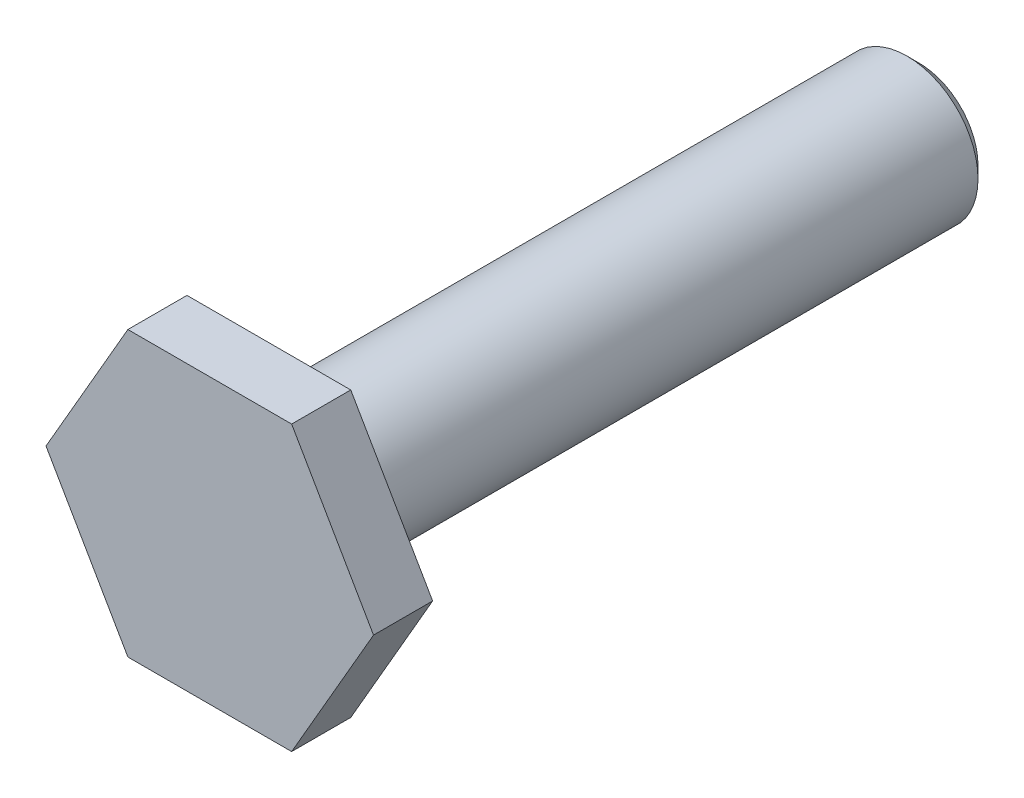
ISO-10303-21;
HEADER;
FILE_DESCRIPTION(('STEP AP214'),'2;1');
FILE_NAME('part.step','',(''),(''),'','','');
FILE_SCHEMA(('AUTOMOTIVE_DESIGN { 1 0 10303 214 1 1 1 1 }'));
ENDSEC;
DATA;
#1=APPLICATION_CONTEXT('core data for automotive mechanical design processes');
#2=APPLICATION_PROTOCOL_DEFINITION('international standard','automotive_design',2000,#1);
#3=PRODUCT_CONTEXT('',#1,'mechanical');
#4=PRODUCT('Part','Part','',(#3));
#5=PRODUCT_RELATED_PRODUCT_CATEGORY('part','',(#4));
#6=PRODUCT_DEFINITION_FORMATION('','',#4);
#7=PRODUCT_DEFINITION_CONTEXT('part definition',#1,'design');
#8=PRODUCT_DEFINITION('design','',#6,#7);
#9=PRODUCT_DEFINITION_SHAPE('','',#8);
#10=(LENGTH_UNIT() NAMED_UNIT(*) SI_UNIT(.MILLI.,.METRE.));
#11=(NAMED_UNIT(*) PLANE_ANGLE_UNIT() SI_UNIT($,.RADIAN.));
#12=(NAMED_UNIT(*) SI_UNIT($,.STERADIAN.) SOLID_ANGLE_UNIT());
#13=UNCERTAINTY_MEASURE_WITH_UNIT(LENGTH_MEASURE(1.E-05),#10,'distance_accuracy_value','');
#14=(GEOMETRIC_REPRESENTATION_CONTEXT(3) GLOBAL_UNCERTAINTY_ASSIGNED_CONTEXT((#13)) GLOBAL_UNIT_ASSIGNED_CONTEXT((#10,
#11,#12)) REPRESENTATION_CONTEXT('',''));
#15=CARTESIAN_POINT('',(0.,0.,0.));
#16=DIRECTION('',(0.,0.,1.));
#17=DIRECTION('',(1.,0.,0.));
#18=AXIS2_PLACEMENT_3D('',#15,#16,#17);
#19=CARTESIAN_POINT('',(0.,0.,5.));
#20=DIRECTION('',(0.,0.,1.));
#21=DIRECTION('',(1.,0.,0.));
#22=AXIS2_PLACEMENT_3D('',#19,#20,#21);
#23=PLANE('',#22);
#24=DIRECTION('',(0.5,-0.866025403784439,0.));
#25=VECTOR('',#24,1.);
#26=CARTESIAN_POINT('',(-6.92820323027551,-12.,5.));
#27=LINE('',#26,#25);
#28=CARTESIAN_POINT('',(-6.92820323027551,-12.,5.));
#29=VERTEX_POINT('',#28);
#30=CARTESIAN_POINT('',(-13.856406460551,0.,5.));
#31=VERTEX_POINT('',#30);
#32=EDGE_CURVE('E89',#29,#31,#27,.F.);
#33=ORIENTED_EDGE('',*,*,#32,.F.);
#34=DIRECTION('',(1.,0.,0.));
#35=VECTOR('',#34,1.);
#36=CARTESIAN_POINT('',(6.92820323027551,-12.,5.));
#37=LINE('',#36,#35);
#38=CARTESIAN_POINT('',(6.92820323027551,-12.,5.));
#39=VERTEX_POINT('',#38);
#40=EDGE_CURVE('E98',#39,#29,#37,.F.);
#41=ORIENTED_EDGE('',*,*,#40,.F.);
#42=DIRECTION('',(0.5,0.866025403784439,0.));
#43=VECTOR('',#42,1.);
#44=CARTESIAN_POINT('',(13.856406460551,0.,5.));
#45=LINE('',#44,#43);
#46=CARTESIAN_POINT('',(13.856406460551,0.,5.));
#47=VERTEX_POINT('',#46);
#48=EDGE_CURVE('E62',#47,#39,#45,.F.);
#49=ORIENTED_EDGE('',*,*,#48,.F.);
#50=DIRECTION('',(-0.5,0.866025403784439,0.));
#51=VECTOR('',#50,1.);
#52=CARTESIAN_POINT('',(6.92820323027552,12.,5.));
#53=LINE('',#52,#51);
#54=CARTESIAN_POINT('',(6.92820323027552,12.,5.));
#55=VERTEX_POINT('',#54);
#56=EDGE_CURVE('E66',#55,#47,#53,.F.);
#57=ORIENTED_EDGE('',*,*,#56,.F.);
#58=DIRECTION('',(1.,0.,0.));
#59=VECTOR('',#58,1.);
#60=CARTESIAN_POINT('',(-6.92820323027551,12.,5.));
#61=LINE('',#60,#59);
#62=CARTESIAN_POINT('',(-6.92820323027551,12.,5.));
#63=VERTEX_POINT('',#62);
#64=EDGE_CURVE('E76',#63,#55,#61,.T.);
#65=ORIENTED_EDGE('',*,*,#64,.F.);
#66=DIRECTION('',(-0.5,-0.866025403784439,0.));
#67=VECTOR('',#66,1.);
#68=CARTESIAN_POINT('',(-13.856406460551,0.,5.));
#69=LINE('',#68,#67);
#70=EDGE_CURVE('E79',#31,#63,#69,.F.);
#71=ORIENTED_EDGE('',*,*,#70,.F.);
#72=EDGE_LOOP('',(#33,#41,#49,#57,#65,#71));
#73=FACE_BOUND('',#72,.T.);
#74=ADVANCED_FACE('F16',(#73),#23,.T.);
#75=CARTESIAN_POINT('',(-6.92820323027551,12.,0.));
#76=DIRECTION('',(0.,1.,0.));
#77=DIRECTION('',(0.,0.,1.));
#78=AXIS2_PLACEMENT_3D('',#75,#76,#77);
#79=PLANE('',#78);
#80=DIRECTION('',(1.,0.,0.));
#81=VECTOR('',#80,1.);
#82=CARTESIAN_POINT('',(0.,12.,0.));
#83=LINE('',#82,#81);
#84=CARTESIAN_POINT('',(6.92820323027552,12.,0.));
#85=VERTEX_POINT('',#84);
#86=CARTESIAN_POINT('',(-6.92820323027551,12.,0.));
#87=VERTEX_POINT('',#86);
#88=EDGE_CURVE('E86',#85,#87,#83,.F.);
#89=ORIENTED_EDGE('',*,*,#88,.T.);
#90=DIRECTION('',(0.,0.,1.));
#91=VECTOR('',#90,1.);
#92=CARTESIAN_POINT('',(-6.92820323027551,12.,0.));
#93=LINE('',#92,#91);
#94=EDGE_CURVE('E83',#63,#87,#93,.F.);
#95=ORIENTED_EDGE('',*,*,#94,.F.);
#96=ORIENTED_EDGE('',*,*,#64,.T.);
#97=DIRECTION('',(0.,0.,1.));
#98=VECTOR('',#97,1.);
#99=CARTESIAN_POINT('',(6.92820323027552,12.,0.));
#100=LINE('',#99,#98);
#101=EDGE_CURVE('E54',#85,#55,#100,.T.);
#102=ORIENTED_EDGE('',*,*,#101,.F.);
#103=EDGE_LOOP('',(#89,#95,#96,#102));
#104=FACE_BOUND('',#103,.T.);
#105=ADVANCED_FACE('F84',(#104),#79,.T.);
#106=CARTESIAN_POINT('',(-13.856406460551,0.,0.));
#107=DIRECTION('',(-0.866025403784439,0.5,0.));
#108=DIRECTION('',(-0.5,-0.866025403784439,0.));
#109=AXIS2_PLACEMENT_3D('',#106,#107,#108);
#110=PLANE('',#109);
#111=DIRECTION('',(-0.5,-0.866025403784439,0.));
#112=VECTOR('',#111,1.);
#113=CARTESIAN_POINT('',(-6.92820323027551,12.,0.));
#114=LINE('',#113,#112);
#115=CARTESIAN_POINT('',(-13.856406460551,0.,0.));
#116=VERTEX_POINT('',#115);
#117=EDGE_CURVE('E119',#87,#116,#114,.T.);
#118=ORIENTED_EDGE('',*,*,#117,.T.);
#119=DIRECTION('',(0.,0.,1.));
#120=VECTOR('',#119,1.);
#121=CARTESIAN_POINT('',(-13.856406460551,0.,0.));
#122=LINE('',#121,#120);
#123=EDGE_CURVE('E93',#31,#116,#122,.F.);
#124=ORIENTED_EDGE('',*,*,#123,.F.);
#125=ORIENTED_EDGE('',*,*,#70,.T.);
#126=ORIENTED_EDGE('',*,*,#94,.T.);
#127=EDGE_LOOP('',(#118,#124,#125,#126));
#128=FACE_BOUND('',#127,.T.);
#129=ADVANCED_FACE('F91',(#128),#110,.T.);
#130=CARTESIAN_POINT('',(-6.92820323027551,-12.,0.));
#131=DIRECTION('',(-0.866025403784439,-0.5,0.));
#132=DIRECTION('',(0.5,-0.866025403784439,0.));
#133=AXIS2_PLACEMENT_3D('',#130,#131,#132);
#134=PLANE('',#133);
#135=DIRECTION('',(0.5,-0.866025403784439,0.));
#136=VECTOR('',#135,1.);
#137=CARTESIAN_POINT('',(-13.856406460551,0.,0.));
#138=LINE('',#137,#136);
#139=CARTESIAN_POINT('',(-6.92820323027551,-12.,0.));
#140=VERTEX_POINT('',#139);
#141=EDGE_CURVE('E117',#116,#140,#138,.T.);
#142=ORIENTED_EDGE('',*,*,#141,.T.);
#143=DIRECTION('',(0.,0.,1.));
#144=VECTOR('',#143,1.);
#145=CARTESIAN_POINT('',(-6.92820323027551,-12.,0.));
#146=LINE('',#145,#144);
#147=EDGE_CURVE('E100',#29,#140,#146,.F.);
#148=ORIENTED_EDGE('',*,*,#147,.F.);
#149=ORIENTED_EDGE('',*,*,#32,.T.);
#150=ORIENTED_EDGE('',*,*,#123,.T.);
#151=EDGE_LOOP('',(#142,#148,#149,#150));
#152=FACE_BOUND('',#151,.T.);
#153=ADVANCED_FACE('F182',(#152),#134,.T.);
#154=CARTESIAN_POINT('',(6.92820323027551,-12.,0.));
#155=DIRECTION('',(0.,-1.,0.));
#156=DIRECTION('',(1.,0.,0.));
#157=AXIS2_PLACEMENT_3D('',#154,#155,#156);
#158=PLANE('',#157);
#159=DIRECTION('',(1.,0.,0.));
#160=VECTOR('',#159,1.);
#161=CARTESIAN_POINT('',(0.,-12.,0.));
#162=LINE('',#161,#160);
#163=CARTESIAN_POINT('',(6.92820323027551,-12.,0.));
#164=VERTEX_POINT('',#163);
#165=EDGE_CURVE('E115',#140,#164,#162,.T.);
#166=ORIENTED_EDGE('',*,*,#165,.T.);
#167=DIRECTION('',(0.,0.,1.));
#168=VECTOR('',#167,1.);
#169=CARTESIAN_POINT('',(6.9282032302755,-12.,0.));
#170=LINE('',#169,#168);
#171=EDGE_CURVE('E105',#39,#164,#170,.F.);
#172=ORIENTED_EDGE('',*,*,#171,.F.);
#173=ORIENTED_EDGE('',*,*,#40,.T.);
#174=ORIENTED_EDGE('',*,*,#147,.T.);
#175=EDGE_LOOP('',(#166,#172,#173,#174));
#176=FACE_BOUND('',#175,.T.);
#177=ADVANCED_FACE('F175',(#176),#158,.T.);
#178=CARTESIAN_POINT('',(13.856406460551,0.,0.));
#179=DIRECTION('',(0.866025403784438,-0.5,0.));
#180=DIRECTION('',(0.5,0.866025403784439,0.));
#181=AXIS2_PLACEMENT_3D('',#178,#179,#180);
#182=PLANE('',#181);
#183=DIRECTION('',(0.5,0.866025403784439,0.));
#184=VECTOR('',#183,1.);
#185=CARTESIAN_POINT('',(6.92820323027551,-12.,0.));
#186=LINE('',#185,#184);
#187=CARTESIAN_POINT('',(13.856406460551,0.,0.));
#188=VERTEX_POINT('',#187);
#189=EDGE_CURVE('E35',#164,#188,#186,.T.);
#190=ORIENTED_EDGE('',*,*,#189,.T.);
#191=DIRECTION('',(0.,0.,1.));
#192=VECTOR('',#191,1.);
#193=CARTESIAN_POINT('',(13.856406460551,0.,0.));
#194=LINE('',#193,#192);
#195=EDGE_CURVE('E109',#47,#188,#194,.F.);
#196=ORIENTED_EDGE('',*,*,#195,.F.);
#197=ORIENTED_EDGE('',*,*,#48,.T.);
#198=ORIENTED_EDGE('',*,*,#171,.T.);
#199=EDGE_LOOP('',(#190,#196,#197,#198));
#200=FACE_BOUND('',#199,.T.);
#201=ADVANCED_FACE('F142',(#200),#182,.T.);
#202=CARTESIAN_POINT('',(6.92820323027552,12.,0.));
#203=DIRECTION('',(0.866025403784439,0.5,0.));
#204=DIRECTION('',(-0.5,0.866025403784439,0.));
#205=AXIS2_PLACEMENT_3D('',#202,#203,#204);
#206=PLANE('',#205);
#207=DIRECTION('',(-0.5,0.866025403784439,0.));
#208=VECTOR('',#207,1.);
#209=CARTESIAN_POINT('',(13.856406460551,0.,0.));
#210=LINE('',#209,#208);
#211=EDGE_CURVE('E112',#188,#85,#210,.T.);
#212=ORIENTED_EDGE('',*,*,#211,.T.);
#213=ORIENTED_EDGE('',*,*,#101,.T.);
#214=ORIENTED_EDGE('',*,*,#56,.T.);
#215=ORIENTED_EDGE('',*,*,#195,.T.);
#216=EDGE_LOOP('',(#212,#213,#214,#215));
#217=FACE_BOUND('',#216,.T.);
#218=ADVANCED_FACE('F133',(#217),#206,.T.);
#219=CARTESIAN_POINT('',(0.,0.,-55.));
#220=DIRECTION('',(0.,0.,1.));
#221=DIRECTION('',(1.,0.,0.));
#222=AXIS2_PLACEMENT_3D('',#219,#220,#221);
#223=PLANE('',#222);
#224=CARTESIAN_POINT('',(0.,0.,-54.9999999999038));
#225=DIRECTION('',(0.,0.,1.));
#226=DIRECTION('',(1.,0.,0.));
#227=AXIS2_PLACEMENT_3D('',#224,#225,#226);
#228=CIRCLE('',#227,5.00000000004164);
#229=CARTESIAN_POINT('',(5.00000000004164,0.,-54.9999999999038));
#230=VERTEX_POINT('',#229);
#231=EDGE_CURVE('E20',#230,#230,#228,.T.);
#232=ORIENTED_EDGE('',*,*,#231,.F.);
#233=EDGE_LOOP('',(#232));
#234=FACE_BOUND('',#233,.T.);
#235=ADVANCED_FACE('F130',(#234),#223,.F.);
#236=CARTESIAN_POINT('',(0.,0.,0.));
#237=DIRECTION('',(0.,0.,1.));
#238=DIRECTION('',(1.,0.,0.));
#239=AXIS2_PLACEMENT_3D('',#236,#237,#238);
#240=PLANE('',#239);
#241=ORIENTED_EDGE('',*,*,#189,.F.);
#242=ORIENTED_EDGE('',*,*,#165,.F.);
#243=ORIENTED_EDGE('',*,*,#141,.F.);
#244=ORIENTED_EDGE('',*,*,#117,.F.);
#245=ORIENTED_EDGE('',*,*,#88,.F.);
#246=ORIENTED_EDGE('',*,*,#211,.F.);
#247=EDGE_LOOP('',(#241,#242,#243,#244,#245,#246));
#248=FACE_BOUND('',#247,.T.);
#249=CARTESIAN_POINT('',(0.,0.,0.));
#250=DIRECTION('',(0.,0.,-1.));
#251=DIRECTION('',(-1.,0.,0.));
#252=AXIS2_PLACEMENT_3D('',#249,#250,#251);
#253=CIRCLE('',#252,6.);
#254=CARTESIAN_POINT('',(-6.,0.,0.));
#255=VERTEX_POINT('',#254);
#256=EDGE_CURVE('E26',#255,#255,#253,.T.);
#257=ORIENTED_EDGE('',*,*,#256,.F.);
#258=EDGE_LOOP('',(#257));
#259=FACE_BOUND('',#258,.T.);
#260=ADVANCED_FACE('F132',(#248,#259),#240,.F.);
#261=CARTESIAN_POINT('',(0.,0.,-53.9999999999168));
#262=DIRECTION('',(0.,0.,1.));
#263=DIRECTION('',(1.,0.,0.));
#264=AXIS2_PLACEMENT_3D('',#261,#262,#263);
#265=CONICAL_SURFACE('',#264,6.00000000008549,0.78539816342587);
#266=ORIENTED_EDGE('',*,*,#231,.T.);
#267=EDGE_LOOP('',(#266));
#268=FACE_BOUND('',#267,.T.);
#269=CARTESIAN_POINT('',(0.,0.,-54.));
#270=DIRECTION('',(0.,0.,-1.));
#271=DIRECTION('',(-1.,0.,0.));
#272=AXIS2_PLACEMENT_3D('',#269,#270,#271);
#273=CIRCLE('',#272,6.);
#274=CARTESIAN_POINT('',(-6.,0.,-54.));
#275=VERTEX_POINT('',#274);
#276=EDGE_CURVE('E10',#275,#275,#273,.F.);
#277=ORIENTED_EDGE('',*,*,#276,.F.);
#278=EDGE_LOOP('',(#277));
#279=FACE_BOUND('',#278,.T.);
#280=ADVANCED_FACE('F127',(#268,#279),#265,.T.);
#281=CARTESIAN_POINT('',(0.,0.,0.));
#282=DIRECTION('',(0.,0.,-1.));
#283=DIRECTION('',(-1.,0.,0.));
#284=AXIS2_PLACEMENT_3D('',#281,#282,#283);
#285=CYLINDRICAL_SURFACE('',#284,6.);
#286=ORIENTED_EDGE('',*,*,#256,.T.);
#287=EDGE_LOOP('',(#286));
#288=FACE_BOUND('',#287,.T.);
#289=ORIENTED_EDGE('',*,*,#276,.T.);
#290=EDGE_LOOP('',(#289));
#291=FACE_BOUND('',#290,.T.);
#292=ADVANCED_FACE('F18',(#288,#291),#285,.T.);
#293=CLOSED_SHELL('',(#74,#105,#129,#153,#177,#201,#218,#235,#260,#280,#292));
#294=MANIFOLD_SOLID_BREP('B1',#293);
#295=ADVANCED_BREP_SHAPE_REPRESENTATION('',(#18,#294),#14);
#296=SHAPE_DEFINITION_REPRESENTATION(#9,#295);
ENDSEC;
END-ISO-10303-21;
